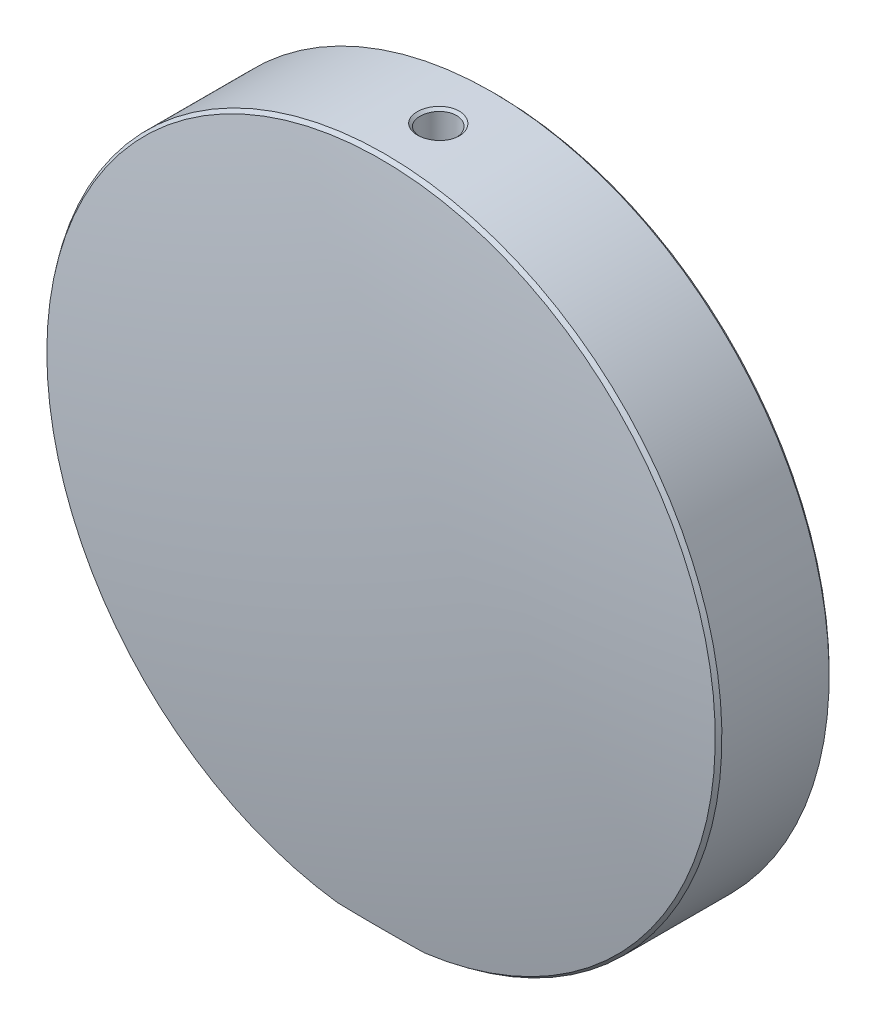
ISO-10303-21;
HEADER;
FILE_DESCRIPTION(('STEP AP214'),'2;1');
FILE_NAME('part.step','',(''),(''),'','','');
FILE_SCHEMA(('AUTOMOTIVE_DESIGN { 1 0 10303 214 1 1 1 1 }'));
ENDSEC;
DATA;
#1=APPLICATION_CONTEXT('core data for automotive mechanical design processes');
#2=APPLICATION_PROTOCOL_DEFINITION('international standard','automotive_design',2000,#1);
#3=PRODUCT_CONTEXT('',#1,'mechanical');
#4=PRODUCT('Part','Part','',(#3));
#5=PRODUCT_RELATED_PRODUCT_CATEGORY('part','',(#4));
#6=PRODUCT_DEFINITION_FORMATION('','',#4);
#7=PRODUCT_DEFINITION_CONTEXT('part definition',#1,'design');
#8=PRODUCT_DEFINITION('design','',#6,#7);
#9=PRODUCT_DEFINITION_SHAPE('','',#8);
#10=(LENGTH_UNIT() NAMED_UNIT(*) SI_UNIT(.MILLI.,.METRE.));
#11=(NAMED_UNIT(*) PLANE_ANGLE_UNIT() SI_UNIT($,.RADIAN.));
#12=(NAMED_UNIT(*) SI_UNIT($,.STERADIAN.) SOLID_ANGLE_UNIT());
#13=UNCERTAINTY_MEASURE_WITH_UNIT(LENGTH_MEASURE(1.E-05),#10,'distance_accuracy_value','');
#14=(GEOMETRIC_REPRESENTATION_CONTEXT(3) GLOBAL_UNCERTAINTY_ASSIGNED_CONTEXT((#13)) GLOBAL_UNIT_ASSIGNED_CONTEXT((#10,
#11,#12)) REPRESENTATION_CONTEXT('',''));
#15=CARTESIAN_POINT('',(0.,0.,0.));
#16=DIRECTION('',(0.,0.,1.));
#17=DIRECTION('',(1.,0.,0.));
#18=AXIS2_PLACEMENT_3D('',#15,#16,#17);
#19=CARTESIAN_POINT('',(0.,0.,355.));
#20=DIRECTION('',(0.,0.,-1.));
#21=DIRECTION('',(1.,0.,0.));
#22=AXIS2_PLACEMENT_3D('',#19,#20,#21);
#23=SPHERICAL_SURFACE('',#22,370.);
#24=CARTESIAN_POINT('',(0.,-59.,355.));
#25=DIRECTION('',(0.,1.,0.));
#26=DIRECTION('',(0.,0.,1.));
#27=AXIS2_PLACEMENT_3D('',#24,#25,#26);
#28=CIRCLE('',#27,365.265656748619);
#29=CARTESIAN_POINT('',(-6.90145713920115,-59.,-10.2004516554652));
#30=VERTEX_POINT('',#29);
#31=CARTESIAN_POINT('',(6.90145713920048,-59.,-10.2004516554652));
#32=VERTEX_POINT('',#31);
#33=EDGE_CURVE('E80',#30,#32,#28,.F.);
#34=ORIENTED_EDGE('',*,*,#33,.F.);
#35=CARTESIAN_POINT('',(0.,0.,-10.2004516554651));
#36=DIRECTION('',(0.,0.,1.));
#37=DIRECTION('',(1.,0.,0.));
#38=AXIS2_PLACEMENT_3D('',#35,#36,#37);
#39=CIRCLE('',#38,59.4022736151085);
#40=EDGE_CURVE('E43',#30,#32,#39,.F.);
#41=ORIENTED_EDGE('',*,*,#40,.T.);
#42=EDGE_LOOP('',(#34,#41));
#43=FACE_BOUND('',#42,.T.);
#44=ADVANCED_FACE('F31',(#43),#23,.T.);
#45=CARTESIAN_POINT('',(0.,0.,-355.));
#46=DIRECTION('',(0.,0.,-1.));
#47=DIRECTION('',(-1.,0.,0.));
#48=AXIS2_PLACEMENT_3D('',#45,#46,#47);
#49=SPHERICAL_SURFACE('',#48,370.);
#50=CARTESIAN_POINT('',(0.,-59.,-355.));
#51=DIRECTION('',(0.,1.,0.));
#52=DIRECTION('',(0.,0.,1.));
#53=AXIS2_PLACEMENT_3D('',#50,#51,#52);
#54=CIRCLE('',#53,365.265656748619);
#55=CARTESIAN_POINT('',(7.75052829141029,-59.,10.1834187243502));
#56=VERTEX_POINT('',#55);
#57=CARTESIAN_POINT('',(-7.75052829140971,-59.,10.1834187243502));
#58=VERTEX_POINT('',#57);
#59=EDGE_CURVE('E90',#56,#58,#54,.F.);
#60=ORIENTED_EDGE('',*,*,#59,.F.);
#61=CARTESIAN_POINT('',(0.,0.,10.1834187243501));
#62=DIRECTION('',(0.,0.,-1.));
#63=DIRECTION('',(-1.,0.,0.));
#64=AXIS2_PLACEMENT_3D('',#61,#62,#63);
#65=CIRCLE('',#64,59.5068961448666);
#66=EDGE_CURVE('E11',#56,#58,#65,.F.);
#67=ORIENTED_EDGE('',*,*,#66,.T.);
#68=EDGE_LOOP('',(#60,#67));
#69=FACE_BOUND('',#68,.T.);
#70=ADVANCED_FACE('F183',(#69),#49,.T.);
#71=CARTESIAN_POINT('',(0.,0.,-15.));
#72=DIRECTION('',(0.,0.,-1.));
#73=DIRECTION('',(-1.,0.,0.));
#74=AXIS2_PLACEMENT_3D('',#71,#72,#73);
#75=CYLINDRICAL_SURFACE('',#74,60.0000000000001);
#76=CARTESIAN_POINT('',(0.,60.0000000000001,3.71918708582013));
#77=CARTESIAN_POINT('',(0.98309913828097,59.99999827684,3.71915412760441));
#78=CARTESIAN_POINT('',(1.95547267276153,59.9727258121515,3.31800584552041));
#79=CARTESIAN_POINT('',(3.34418440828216,59.9101905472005,1.94125209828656));
#80=CARTESIAN_POINT('',(3.7471732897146,59.8828813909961,0.976504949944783));
#81=CARTESIAN_POINT('',(3.74700745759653,59.8828785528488,-0.972626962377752));
#82=CARTESIAN_POINT('',(3.34579960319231,59.9101294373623,-1.93867792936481));
#83=CARTESIAN_POINT('',(1.95610115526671,59.9726877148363,-3.31835170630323));
#84=CARTESIAN_POINT('',(0.98805830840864,59.9999988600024,-3.71916027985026));
#85=CARTESIAN_POINT('',(-0.988039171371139,60.0000011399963,-3.71921389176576));
#86=CARTESIAN_POINT('',(-1.9559865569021,59.9726924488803,-3.31845552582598));
#87=CARTESIAN_POINT('',(-3.34570013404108,59.9101341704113,-1.93878679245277));
#88=CARTESIAN_POINT('',(-3.74700972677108,59.8828779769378,-0.972599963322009));
#89=CARTESIAN_POINT('',(-3.74717094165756,59.882881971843,0.976625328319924));
#90=CARTESIAN_POINT('',(-3.34413653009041,59.9101910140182,1.94125290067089));
#91=CARTESIAN_POINT('',(-1.95552604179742,59.9727251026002,3.3179995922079));
#92=CARTESIAN_POINT('',(-0.983099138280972,60.0000017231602,3.71922004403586));
#93=CARTESIAN_POINT('',(0.,60.0000000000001,3.71918708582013));
#94=B_SPLINE_CURVE_WITH_KNOTS('',3,(#76,#77,#78,#79,#80,#81,#82,#83,#84,#85,#86,#87,#88,#89,#90,
#91,#92,#93),.UNSPECIFIED.,.T.,.F.,(4,2,2,2,2,2,2,2,4),(-0.023256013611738,-0.0203486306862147,
-0.0174412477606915,-0.0145338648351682,-0.0116264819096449,-0.00871909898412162,
-0.00581171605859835,-0.00290433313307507,3.04979244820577E-06),.UNSPECIFIED.);
#95=CARTESIAN_POINT('',(0.,60.0000000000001,3.71918708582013));
#96=VERTEX_POINT('',#95);
#97=EDGE_CURVE('E93',#96,#96,#94,.F.);
#98=ORIENTED_EDGE('',*,*,#97,.T.);
#99=EDGE_LOOP('',(#98));
#100=FACE_BOUND('',#99,.T.);
#101=DIRECTION('',(0.,0.,-1.));
#102=VECTOR('',#101,1.);
#103=CARTESIAN_POINT('',(10.9087121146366,-58.9999999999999,-15.));
#104=LINE('',#103,#102);
#105=CARTESIAN_POINT('',(10.9087121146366,-58.9999999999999,-9.6027252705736));
#106=VERTEX_POINT('',#105);
#107=CARTESIAN_POINT('',(10.9087121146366,-58.9999999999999,9.49637211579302));
#108=VERTEX_POINT('',#107);
#109=EDGE_CURVE('E89',#106,#108,#104,.F.);
#110=ORIENTED_EDGE('',*,*,#109,.F.);
#111=CARTESIAN_POINT('',(0.,0.,-9.6027252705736));
#112=DIRECTION('',(0.,0.,-1.));
#113=DIRECTION('',(-1.,0.,0.));
#114=AXIS2_PLACEMENT_3D('',#111,#112,#113);
#115=CIRCLE('',#114,60.0000000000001);
#116=CARTESIAN_POINT('',(-10.9087121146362,-59.,-9.6027252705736));
#117=VERTEX_POINT('',#116);
#118=EDGE_CURVE('E51',#106,#117,#115,.F.);
#119=ORIENTED_EDGE('',*,*,#118,.T.);
#120=DIRECTION('',(0.,0.,-1.));
#121=VECTOR('',#120,1.);
#122=CARTESIAN_POINT('',(-10.9087121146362,-59.,-15.));
#123=LINE('',#122,#121);
#124=CARTESIAN_POINT('',(-10.9087121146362,-59.,9.49637211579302));
#125=VERTEX_POINT('',#124);
#126=EDGE_CURVE('E81',#125,#117,#123,.T.);
#127=ORIENTED_EDGE('',*,*,#126,.F.);
#128=CARTESIAN_POINT('',(0.,0.,9.49637211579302));
#129=DIRECTION('',(0.,0.,1.));
#130=DIRECTION('',(1.,0.,0.));
#131=AXIS2_PLACEMENT_3D('',#128,#129,#130);
#132=CIRCLE('',#131,60.0000000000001);
#133=EDGE_CURVE('E174',#125,#108,#132,.F.);
#134=ORIENTED_EDGE('',*,*,#133,.T.);
#135=EDGE_LOOP('',(#110,#119,#127,#134));
#136=FACE_BOUND('',#135,.T.);
#137=ADVANCED_FACE('F149',(#100,#136),#75,.T.);
#138=CARTESIAN_POINT('',(-10.9087121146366,-59.,-15.));
#139=DIRECTION('',(0.,1.,0.));
#140=DIRECTION('',(0.,0.,1.));
#141=AXIS2_PLACEMENT_3D('',#138,#139,#140);
#142=PLANE('',#141);
#143=CARTESIAN_POINT('',(0.,-59.,0.));
#144=DIRECTION('',(0.,1.,0.));
#145=DIRECTION('',(0.,0.,1.));
#146=AXIS2_PLACEMENT_3D('',#143,#144,#145);
#147=CIRCLE('',#146,3.74999999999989);
#148=CARTESIAN_POINT('',(0.,-59.,3.74999999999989));
#149=VERTEX_POINT('',#148);
#150=EDGE_CURVE('E143',#149,#149,#147,.T.);
#151=ORIENTED_EDGE('',*,*,#150,.T.);
#152=EDGE_LOOP('',(#151));
#153=FACE_BOUND('',#152,.T.);
#154=ORIENTED_EDGE('',*,*,#33,.T.);
#155=CARTESIAN_POINT('',(6.90145713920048,-59.,-10.2004516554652));
#156=CARTESIAN_POINT('',(7.23693616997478,-59.,-10.1614766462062));
#157=CARTESIAN_POINT('',(7.57209222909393,-59.,-10.1197325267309));
#158=CARTESIAN_POINT('',(8.24159408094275,-59.,-10.0308034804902));
#159=CARTESIAN_POINT('',(8.57594006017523,-59.,-9.98361995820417));
#160=CARTESIAN_POINT('',(9.24382887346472,-59.,-9.88388957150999));
#161=CARTESIAN_POINT('',(9.57737171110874,-59.,-9.83134273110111));
#162=CARTESIAN_POINT('',(10.2436710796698,-59.,-9.72096853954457));
#163=CARTESIAN_POINT('',(10.5764273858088,-59.,-9.66313983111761));
#164=CARTESIAN_POINT('',(10.9087121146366,-59.,-9.60272527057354));
#165=B_SPLINE_CURVE_WITH_KNOTS('',3,(#155,#156,#157,#158,#159,#160,#161,#162,#163,#164),
.UNSPECIFIED.,.F.,.F.,(4,2,2,2,4),(0.,1.01319304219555,2.02612505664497,3.03905253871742,
4.05224104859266),.UNSPECIFIED.);
#166=EDGE_CURVE('E84',#32,#106,#165,.T.);
#167=ORIENTED_EDGE('',*,*,#166,.T.);
#168=ORIENTED_EDGE('',*,*,#109,.T.);
#169=CARTESIAN_POINT('',(10.9087121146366,-58.9999999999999,9.49637211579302));
#170=CARTESIAN_POINT('',(10.6475336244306,-59.,9.56253476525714));
#171=CARTESIAN_POINT('',(10.3858063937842,-59.,9.62653721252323));
#172=CARTESIAN_POINT('',(9.86138802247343,-59.,9.75010480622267));
#173=CARTESIAN_POINT('',(9.59869718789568,-59.,9.80967125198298));
#174=CARTESIAN_POINT('',(9.07233019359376,-59.,9.92428926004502));
#175=CARTESIAN_POINT('',(8.80865402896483,-59.,9.97934079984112));
#176=CARTESIAN_POINT('',(8.28030419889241,-59.,10.0848523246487));
#177=CARTESIAN_POINT('',(8.01563026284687,-59.,10.1353109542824));
#178=CARTESIAN_POINT('',(7.75052829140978,-59.,10.1834187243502));
#179=B_SPLINE_CURVE_WITH_KNOTS('',3,(#169,#170,#171,#172,#173,#174,#175,#176,#177,#178),
.UNSPECIFIED.,.F.,.F.,(4,2,2,2,4),(0.,0.808278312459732,1.61631893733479,2.4243635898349,
3.23264593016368),.UNSPECIFIED.);
#180=EDGE_CURVE('E85',#108,#56,#179,.T.);
#181=ORIENTED_EDGE('',*,*,#180,.T.);
#182=ORIENTED_EDGE('',*,*,#59,.T.);
#183=CARTESIAN_POINT('',(-7.75052829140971,-59.,10.1834187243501));
#184=CARTESIAN_POINT('',(-8.01563026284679,-59.,10.1353109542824));
#185=CARTESIAN_POINT('',(-8.2803041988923,-59.,10.0848523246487));
#186=CARTESIAN_POINT('',(-8.80865402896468,-59.,9.97934079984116));
#187=CARTESIAN_POINT('',(-9.07233019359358,-59.,9.92428926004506));
#188=CARTESIAN_POINT('',(-9.59869718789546,-59.,9.80967125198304));
#189=CARTESIAN_POINT('',(-9.86138802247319,-59.,9.75010480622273));
#190=CARTESIAN_POINT('',(-10.3858063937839,-59.,9.62653721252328));
#191=CARTESIAN_POINT('',(-10.6475336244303,-59.,9.56253476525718));
#192=CARTESIAN_POINT('',(-10.9087121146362,-59.,9.49637211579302));
#193=B_SPLINE_CURVE_WITH_KNOTS('',3,(#183,#184,#185,#186,#187,#188,#189,#190,#191,#192),
.UNSPECIFIED.,.F.,.F.,(4,2,2,2,4),(0.,0.808282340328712,1.61632699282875,2.42436761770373,
3.23264593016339),.UNSPECIFIED.);
#194=EDGE_CURVE('E58',#58,#125,#193,.T.);
#195=ORIENTED_EDGE('',*,*,#194,.T.);
#196=ORIENTED_EDGE('',*,*,#126,.T.);
#197=CARTESIAN_POINT('',(-10.9087121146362,-59.,-9.6027252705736));
#198=CARTESIAN_POINT('',(-10.5764273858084,-59.,-9.66313983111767));
#199=CARTESIAN_POINT('',(-10.2436710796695,-59.,-9.72096853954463));
#200=CARTESIAN_POINT('',(-9.5773717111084,-59.,-9.83134273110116));
#201=CARTESIAN_POINT('',(-9.24382887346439,-59.,-9.88388957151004));
#202=CARTESIAN_POINT('',(-8.57594006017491,-59.,-9.98361995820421));
#203=CARTESIAN_POINT('',(-8.24159408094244,-59.,-10.0308034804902));
#204=CARTESIAN_POINT('',(-7.57209222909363,-59.,-10.119732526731));
#205=CARTESIAN_POINT('',(-7.23693616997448,-59.,-10.1614766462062));
#206=CARTESIAN_POINT('',(-6.90145713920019,-59.,-10.2004516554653));
#207=B_SPLINE_CURVE_WITH_KNOTS('',3,(#197,#198,#199,#200,#201,#202,#203,#204,#205,#206),
.UNSPECIFIED.,.F.,.F.,(4,2,2,2,4),(0.,1.01318850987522,2.02611599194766,3.03904800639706,
4.0522410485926),.UNSPECIFIED.);
#208=EDGE_CURVE('E77',#117,#30,#207,.T.);
#209=ORIENTED_EDGE('',*,*,#208,.T.);
#210=EDGE_LOOP('',(#154,#167,#168,#181,#182,#195,#196,#209));
#211=FACE_BOUND('',#210,.T.);
#212=ADVANCED_FACE('F79',(#153,#211),#142,.F.);
#213=CARTESIAN_POINT('',(0.,-60.,0.));
#214=DIRECTION('',(0.,1.,0.));
#215=DIRECTION('',(0.,0.,1.));
#216=AXIS2_PLACEMENT_3D('',#213,#214,#215);
#217=CYLINDRICAL_SURFACE('',#216,3.25);
#218=CARTESIAN_POINT('',(0.,-58.5000000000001,0.));
#219=DIRECTION('',(0.,1.,0.));
#220=DIRECTION('',(0.,0.,1.));
#221=AXIS2_PLACEMENT_3D('',#218,#219,#220);
#222=CIRCLE('',#221,3.25);
#223=CARTESIAN_POINT('',(0.,-58.5000000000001,3.25));
#224=VERTEX_POINT('',#223);
#225=EDGE_CURVE('E175',#224,#224,#222,.F.);
#226=ORIENTED_EDGE('',*,*,#225,.T.);
#227=EDGE_LOOP('',(#226));
#228=FACE_BOUND('',#227,.T.);
#229=CARTESIAN_POINT('',(0.,59.5531926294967,3.24999999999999));
#230=CARTESIAN_POINT('',(-0.0532619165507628,59.5531928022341,3.25000258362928));
#231=CARTESIAN_POINT('',(-0.106521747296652,59.5530872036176,3.24863553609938));
#232=CARTESIAN_POINT('',(-0.212855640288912,59.552675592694,3.24320839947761));
#233=CARTESIAN_POINT('',(-0.265929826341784,59.5523697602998,3.23915072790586));
#234=CARTESIAN_POINT('',(-0.371778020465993,59.5515689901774,3.22839134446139));
#235=CARTESIAN_POINT('',(-0.424552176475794,59.5510741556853,3.22169107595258));
#236=CARTESIAN_POINT('',(-0.529687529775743,59.5499067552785,3.20569630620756));
#237=CARTESIAN_POINT('',(-0.582048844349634,59.5492342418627,3.1964025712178));
#238=CARTESIAN_POINT('',(-0.686245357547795,59.5477228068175,3.17527007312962));
#239=CARTESIAN_POINT('',(-0.738080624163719,59.546883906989,3.16343164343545));
#240=CARTESIAN_POINT('',(-0.841112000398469,59.5450510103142,3.13725880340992));
#241=CARTESIAN_POINT('',(-0.892308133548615,59.5440570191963,3.1229244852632));
#242=CARTESIAN_POINT('',(-0.99394815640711,59.5419252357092,3.0918087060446));
#243=CARTESIAN_POINT('',(-1.0443920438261,59.5407874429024,3.07502723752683));
#244=CARTESIAN_POINT('',(-1.14441446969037,59.5383793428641,3.03906586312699));
#245=CARTESIAN_POINT('',(-1.1939930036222,59.5371090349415,3.0198859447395));
#246=CARTESIAN_POINT('',(-1.2921715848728,59.5344471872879,2.97917628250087));
#247=CARTESIAN_POINT('',(-1.34077164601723,59.5330556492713,2.95764657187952));
#248=CARTESIAN_POINT('',(-1.43688012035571,59.5301626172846,2.91228588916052));
#249=CARTESIAN_POINT('',(-1.48438857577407,59.528661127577,2.88845500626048));
#250=CARTESIAN_POINT('',(-1.5782006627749,59.5255594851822,2.83854053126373));
#251=CARTESIAN_POINT('',(-1.62450435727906,59.5239593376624,2.81245705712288));
#252=CARTESIAN_POINT('',(-1.71579376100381,59.5206716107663,2.75808598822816));
#253=CARTESIAN_POINT('',(-1.76077952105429,59.5189840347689,2.72979847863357));
#254=CARTESIAN_POINT('',(-1.84931990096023,59.5155329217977,2.67106795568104));
#255=CARTESIAN_POINT('',(-1.89287449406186,59.5137693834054,2.6406249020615));
#256=CARTESIAN_POINT('',(-1.97843955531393,59.5101769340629,2.57763212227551));
#257=CARTESIAN_POINT('',(-2.02044981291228,59.5083480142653,2.54508211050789));
#258=CARTESIAN_POINT('',(-2.10281294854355,59.5046386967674,2.4779239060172));
#259=CARTESIAN_POINT('',(-2.14316527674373,59.5027582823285,2.4433150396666));
#260=CARTESIAN_POINT('',(-2.22210088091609,59.4989475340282,2.37208946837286));
#261=CARTESIAN_POINT('',(-2.26068305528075,59.4970171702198,2.33547154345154));
#262=CARTESIAN_POINT('',(-2.33591986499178,59.4931563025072,2.26031365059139));
#263=CARTESIAN_POINT('',(-2.37257469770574,59.4912257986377,2.22177388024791));
#264=CARTESIAN_POINT('',(-2.44385968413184,59.4874145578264,2.14291973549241));
#265=CARTESIAN_POINT('',(-2.47849142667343,59.4855337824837,2.10260679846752));
#266=CARTESIAN_POINT('',(-2.54568487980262,59.4818235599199,2.02032198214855));
#267=CARTESIAN_POINT('',(-2.57824757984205,59.4799940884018,1.97835091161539));
#268=CARTESIAN_POINT('',(-2.64125592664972,59.4764003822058,1.89286352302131));
#269=CARTESIAN_POINT('',(-2.67170212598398,59.4746361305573,1.84934761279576));
#270=CARTESIAN_POINT('',(-2.73043067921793,59.471183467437,1.76088447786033));
#271=CARTESIAN_POINT('',(-2.75871329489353,59.4694950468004,1.71593742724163));
#272=CARTESIAN_POINT('',(-2.81306762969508,59.466205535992,1.6247256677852));
#273=CARTESIAN_POINT('',(-2.83913944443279,59.4646044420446,1.57846101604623));
#274=CARTESIAN_POINT('',(-2.88902502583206,59.461500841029,1.48472763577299));
#275=CARTESIAN_POINT('',(-2.91283881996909,59.4599983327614,1.43725892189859));
#276=CARTESIAN_POINT('',(-2.95816109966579,59.4571032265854,1.3412309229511));
#277=CARTESIAN_POINT('',(-2.9796696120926,59.4557106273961,1.29267165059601));
#278=CARTESIAN_POINT('',(-3.0203340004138,59.4530466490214,1.19457600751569));
#279=CARTESIAN_POINT('',(-3.03948993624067,59.4517752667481,1.14503966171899));
#280=CARTESIAN_POINT('',(-3.07540180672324,59.4493650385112,1.04510333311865));
#281=CARTESIAN_POINT('',(-3.09215783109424,59.4482261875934,0.994703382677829));
#282=CARTESIAN_POINT('',(-3.12322252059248,59.4460923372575,0.893153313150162));
#283=CARTESIAN_POINT('',(-3.13753126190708,59.4450973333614,0.842003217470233));
#284=CARTESIAN_POINT('',(-3.16365405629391,59.4432624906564,0.73906634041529));
#285=CARTESIAN_POINT('',(-3.17546808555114,59.4424226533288,0.687279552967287));
#286=CARTESIAN_POINT('',(-3.19655426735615,59.4409094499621,0.583182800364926));
#287=CARTESIAN_POINT('',(-3.20582616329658,59.4402361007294,0.530872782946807));
#288=CARTESIAN_POINT('',(-3.22178082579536,59.4390671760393,0.425843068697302));
#289=CARTESIAN_POINT('',(-3.22846292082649,59.4385716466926,0.373123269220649));
#290=CARTESIAN_POINT('',(-3.23919165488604,59.4377696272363,0.267387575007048));
#291=CARTESIAN_POINT('',(-3.24323697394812,59.4374632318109,0.214371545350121));
#292=CARTESIAN_POINT('',(-3.24864329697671,59.4370508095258,0.108156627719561));
#293=CARTESIAN_POINT('',(-3.25000204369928,59.4369449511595,0.0549576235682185));
#294=CARTESIAN_POINT('',(-3.24999700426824,59.4369445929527,-0.0514453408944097));
#295=CARTESIAN_POINT('',(-3.24863294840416,59.4370501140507,-0.104649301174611));
#296=CARTESIAN_POINT('',(-3.24323099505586,59.4374613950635,-0.210884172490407));
#297=CARTESIAN_POINT('',(-3.23919487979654,59.4377670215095,-0.263915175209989));
#298=CARTESIAN_POINT('',(-3.22849331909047,59.4385672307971,-0.369690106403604));
#299=CARTESIAN_POINT('',(-3.22182881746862,59.4390617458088,-0.422434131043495));
#300=CARTESIAN_POINT('',(-3.20591741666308,59.4402283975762,-0.52752090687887));
#301=CARTESIAN_POINT('',(-3.19667089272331,59.4409005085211,-0.579863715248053));
#302=CARTESIAN_POINT('',(-3.17564137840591,59.4424110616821,-0.684033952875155));
#303=CARTESIAN_POINT('',(-3.16385841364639,59.4432495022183,-0.73586138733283));
#304=CARTESIAN_POINT('',(-3.13780193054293,59.4450814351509,-0.838886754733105));
#305=CARTESIAN_POINT('',(-3.12352825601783,59.4460749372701,-0.890084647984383));
#306=CARTESIAN_POINT('',(-3.09253604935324,59.44820572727,-0.991736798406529));
#307=CARTESIAN_POINT('',(-3.07581729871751,59.4493430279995,-1.0421909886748));
#308=CARTESIAN_POINT('',(-3.03998053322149,59.4517501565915,-1.14224157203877));
#309=CARTESIAN_POINT('',(-3.02086231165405,59.4530199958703,-1.1918378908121));
#310=CARTESIAN_POINT('',(-2.98027212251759,59.4556809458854,-1.29005854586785));
#311=CARTESIAN_POINT('',(-2.9587999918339,59.4570720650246,-1.33868281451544));
#312=CARTESIAN_POINT('',(-2.91354747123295,59.459964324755,-1.43484516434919));
#313=CARTESIAN_POINT('',(-2.88976695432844,59.4614654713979,-1.4823831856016));
#314=CARTESIAN_POINT('',(-2.8399431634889,59.4645665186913,-1.57625884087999));
#315=CARTESIAN_POINT('',(-2.81389975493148,59.4661664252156,-1.62259640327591));
#316=CARTESIAN_POINT('',(-2.75959569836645,59.469453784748,-1.71395693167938));
#317=CARTESIAN_POINT('',(-2.73133483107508,59.4711412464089,-1.75897976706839));
#318=CARTESIAN_POINT('',(-2.6726415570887,59.474592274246,-1.84759678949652));
#319=CARTESIAN_POINT('',(-2.6422087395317,59.4763558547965,-1.89119070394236));
#320=CARTESIAN_POINT('',(-2.57921697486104,59.4799485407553,-1.97683551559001));
#321=CARTESIAN_POINT('',(-2.54665729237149,59.4817776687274,-2.01888587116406));
#322=CARTESIAN_POINT('',(-2.47945881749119,59.4854876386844,-2.10133083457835));
#323=CARTESIAN_POINT('',(-2.44481881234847,59.4873685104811,-2.14172445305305));
#324=CARTESIAN_POINT('',(-2.37350134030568,59.4911802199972,-2.22073777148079));
#325=CARTESIAN_POINT('',(-2.33682201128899,59.4931111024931,-2.2593557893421));
#326=CARTESIAN_POINT('',(-2.2615455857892,59.4969730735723,-2.33466374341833));
#327=CARTESIAN_POINT('',(-2.22294875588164,59.4989041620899,-2.37135394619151));
#328=CARTESIAN_POINT('',(-2.14401298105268,59.5027166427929,-2.4427133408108));
#329=CARTESIAN_POINT('',(-2.1036761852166,59.5045980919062,-2.47738490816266));
#330=CARTESIAN_POINT('',(-2.02136424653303,59.5083095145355,-2.54465568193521));
#331=CARTESIAN_POINT('',(-1.97939049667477,59.5101395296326,-2.57725659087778));
#332=CARTESIAN_POINT('',(-1.89391350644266,59.5137342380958,-2.64034034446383));
#333=CARTESIAN_POINT('',(-1.85041110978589,59.5154989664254,-2.67082433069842));
#334=CARTESIAN_POINT('',(-1.76198405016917,59.5189524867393,-2.72962686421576));
#335=CARTESIAN_POINT('',(-1.71705984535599,59.5206413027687,-2.75794609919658));
#336=CARTESIAN_POINT('',(-1.62589662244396,59.5239315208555,-2.81237205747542));
#337=CARTESIAN_POINT('',(-1.57965779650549,59.5255329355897,-2.83847910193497));
#338=CARTESIAN_POINT('',(-1.48597256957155,59.5286371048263,-2.88843340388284));
#339=CARTESIAN_POINT('',(-1.43852617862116,59.530139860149,-2.91228068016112));
#340=CARTESIAN_POINT('',(-1.34253300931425,59.5330354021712,-2.95766813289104));
#341=CARTESIAN_POINT('',(-1.29398611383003,59.5344281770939,-2.97920806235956));
#342=CARTESIAN_POINT('',(-1.19589906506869,59.5370924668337,-3.01993346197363));
#343=CARTESIAN_POINT('',(-1.14635870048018,59.5383639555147,-3.03911842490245));
#344=CARTESIAN_POINT('',(-1.04639181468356,59.5407743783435,-3.07508652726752));
#345=CARTESIAN_POINT('',(-0.995965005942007,59.5419132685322,-3.09186887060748));
#346=CARTESIAN_POINT('',(-0.894332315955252,59.544047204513,-3.12298439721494));
#347=CARTESIAN_POINT('',(-0.843126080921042,59.5450421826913,-3.13731642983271));
#348=CARTESIAN_POINT('',(-0.740041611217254,59.546877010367,-3.16348406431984));
#349=CARTESIAN_POINT('',(-0.688162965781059,59.5477167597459,-3.17531805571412));
#350=CARTESIAN_POINT('',(-0.583840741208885,59.5492298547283,-3.19644244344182));
#351=CARTESIAN_POINT('',(-0.531396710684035,59.5499030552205,-3.20573062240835));
#352=CARTESIAN_POINT('',(-0.426050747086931,59.5510717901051,-3.22171636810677));
#353=CARTESIAN_POINT('',(-0.373148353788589,59.5515671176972,-3.22841092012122));
#354=CARTESIAN_POINT('',(-0.266992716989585,59.5523688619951,-3.23916259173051));
#355=CARTESIAN_POINT('',(-0.213739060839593,59.5526749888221,-3.24321566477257));
#356=CARTESIAN_POINT('',(-0.106987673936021,59.5530871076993,-3.24863777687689));
#357=CARTESIAN_POINT('',(-0.0534896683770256,59.5531927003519,-3.25000145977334));
#358=CARTESIAN_POINT('',(0.0535066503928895,59.5531925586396,-3.24999854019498));
#359=CARTESIAN_POINT('',(0.107004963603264,59.5530868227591,-3.24863191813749));
#360=CARTESIAN_POINT('',(0.213757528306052,59.5526744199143,-3.24320401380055));
#361=CARTESIAN_POINT('',(0.267012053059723,59.5523681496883,-3.23914805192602));
#362=CARTESIAN_POINT('',(0.373169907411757,59.5515661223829,-3.22839069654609));
#363=CARTESIAN_POINT('',(0.426073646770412,59.5510706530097,-3.22169331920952));
#364=CARTESIAN_POINT('',(0.531422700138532,59.5499016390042,-3.20570203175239));
#365=CARTESIAN_POINT('',(0.583868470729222,59.5492282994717,-3.19641111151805));
#366=CARTESIAN_POINT('',(0.688194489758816,59.5477149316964,-3.17528136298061));
#367=CARTESIAN_POINT('',(0.740075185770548,59.5468750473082,-3.16344473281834));
#368=CARTESIAN_POINT('',(0.843163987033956,59.5450399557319,-3.13727195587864));
#369=CARTESIAN_POINT('',(0.894372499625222,59.5440448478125,-3.12293740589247));
#370=CARTESIAN_POINT('',(0.996009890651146,59.5419106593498,-3.09181699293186));
#371=CARTESIAN_POINT('',(1.04643912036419,59.5407716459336,-3.07503227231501));
#372=CARTESIAN_POINT('',(1.14641090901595,59.538360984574,-3.03905957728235));
#373=CARTESIAN_POINT('',(1.19595375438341,59.5370893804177,-3.01987239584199));
#374=CARTESIAN_POINT('',(1.29404574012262,59.534424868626,-2.97914273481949));
#375=CARTESIAN_POINT('',(1.34259509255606,59.5330319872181,-2.95760076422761));
#376=CARTESIAN_POINT('',(1.43859306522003,59.5301362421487,-2.91220941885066));
#377=CARTESIAN_POINT('',(1.48604180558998,59.5286333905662,-2.88836029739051));
#378=CARTESIAN_POINT('',(1.57973153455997,59.5255290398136,-2.83840250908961));
#379=CARTESIAN_POINT('',(1.62597251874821,59.5239275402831,-2.81229383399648));
#380=CARTESIAN_POINT('',(1.7171397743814,59.5206371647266,-2.75786483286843));
#381=CARTESIAN_POINT('',(1.76206586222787,59.5189482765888,-2.72954419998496));
#382=CARTESIAN_POINT('',(1.85049631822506,59.5154946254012,-2.670739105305));
#383=CARTESIAN_POINT('',(1.89400023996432,59.5137298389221,-2.64025397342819));
#384=CARTESIAN_POINT('',(1.97947981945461,59.5101350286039,-2.57716817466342));
#385=CARTESIAN_POINT('',(2.02145464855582,59.5083049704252,-2.54456638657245));
#386=CARTESIAN_POINT('',(2.1037682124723,59.504593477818,-2.47729413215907));
#387=CARTESIAN_POINT('',(2.1441055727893,59.5027120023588,-2.4426219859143));
#388=CARTESIAN_POINT('',(2.22304179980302,59.4988994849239,-2.37126167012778));
#389=CARTESIAN_POINT('',(2.26163853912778,59.4969683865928,-2.33457114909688));
#390=CARTESIAN_POINT('',(2.33691410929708,59.493106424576,-2.25926314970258));
#391=CARTESIAN_POINT('',(2.37359270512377,59.4911755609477,-2.22064543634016));
#392=CARTESIAN_POINT('',(2.44490816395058,59.4873639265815,-2.14163358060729));
#393=CARTESIAN_POINT('',(2.47954692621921,59.4854831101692,-2.1012411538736));
#394=CARTESIAN_POINT('',(2.54674239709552,59.4817732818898,-2.01879928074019));
#395=CARTESIAN_POINT('',(2.57930035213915,59.4799442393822,-1.97675085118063));
#396=CARTESIAN_POINT('',(2.64228824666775,59.4763517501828,-1.89111052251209));
#397=CARTESIAN_POINT('',(2.67271895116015,59.4745882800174,-1.84751918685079));
#398=CARTESIAN_POINT('',(2.73140766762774,59.4711374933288,-1.7589078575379));
#399=CARTESIAN_POINT('',(2.75966611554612,59.4694501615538,-1.71388815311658));
#400=CARTESIAN_POINT('',(2.81396509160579,59.4661630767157,-1.6225343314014));
#401=CARTESIAN_POINT('',(2.84000585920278,59.464563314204,-1.57620035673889));
#402=CARTESIAN_POINT('',(2.88982421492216,59.4614625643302,-1.4823322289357));
#403=CARTESIAN_POINT('',(2.91360195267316,59.4599615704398,-1.4347981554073));
#404=CARTESIAN_POINT('',(2.95884885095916,59.4570696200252,-1.33864396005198));
#405=CARTESIAN_POINT('',(2.9803181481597,59.4556786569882,-1.2900239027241));
#406=CARTESIAN_POINT('',(3.0209026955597,59.453018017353,-1.19181183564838));
#407=CARTESIAN_POINT('',(3.04001811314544,59.4517483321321,-1.14221989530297));
#408=CARTESIAN_POINT('',(3.07584938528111,59.4493415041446,-1.04217813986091));
#409=CARTESIAN_POINT('',(3.09256544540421,59.4482043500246,-0.991728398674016));
#410=CARTESIAN_POINT('',(3.12355247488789,59.4460738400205,-0.890085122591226));
#411=CARTESIAN_POINT('',(3.13782365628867,59.4450804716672,-0.838891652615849));
#412=CARTESIAN_POINT('',(3.16387544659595,59.4432487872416,-0.735875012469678));
#413=CARTESIAN_POINT('',(3.1756562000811,59.4424104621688,-0.68405187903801));
#414=CARTESIAN_POINT('',(3.19668167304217,59.4409001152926,-0.579890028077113));
#415=CARTESIAN_POINT('',(3.20592635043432,59.4402280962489,-0.527551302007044));
#416=CARTESIAN_POINT('',(3.2218345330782,59.4390615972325,-0.42247237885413));
#417=CARTESIAN_POINT('',(3.2284976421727,59.4385671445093,-0.369732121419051));
#418=CARTESIAN_POINT('',(3.23919696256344,59.4377670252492,-0.263964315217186));
#419=CARTESIAN_POINT('',(3.24323220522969,59.4374614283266,-0.210936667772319));
#420=CARTESIAN_POINT('',(3.24863311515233,59.437050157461,-0.104708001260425));
#421=CARTESIAN_POINT('',(3.24999697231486,59.4369446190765,-0.0515068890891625));
#422=CARTESIAN_POINT('',(3.25000214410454,59.4369449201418,0.0548912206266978));
#423=CARTESIAN_POINT('',(3.24864368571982,59.4370507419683,0.108088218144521));
#424=CARTESIAN_POINT('',(3.24323817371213,59.437463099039,0.214300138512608));
#425=CARTESIAN_POINT('',(3.23919332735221,59.4377694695,0.267315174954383));
#426=CARTESIAN_POINT('',(3.22846577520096,59.4385714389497,0.373049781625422));
#427=CARTESIAN_POINT('',(3.22178434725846,59.4390669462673,0.425769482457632));
#428=CARTESIAN_POINT('',(3.20583117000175,59.4402358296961,0.530799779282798));
#429=CARTESIAN_POINT('',(3.19656005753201,59.4409091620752,0.583110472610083));
#430=CARTESIAN_POINT('',(3.1754755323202,59.4424223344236,0.68720923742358));
#431=CARTESIAN_POINT('',(3.16366234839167,59.4432621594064,0.73899735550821));
#432=CARTESIAN_POINT('',(3.13754126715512,59.4450969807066,0.841937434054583));
#433=CARTESIAN_POINT('',(3.12323337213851,59.4460919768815,0.893089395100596));
#434=CARTESIAN_POINT('',(3.09217033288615,59.4482258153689,0.994643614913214));
#435=CARTESIAN_POINT('',(3.07541509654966,59.4493646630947,1.04504584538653));
#436=CARTESIAN_POINT('',(3.03950469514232,59.4517748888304,1.1449870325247));
#437=CARTESIAN_POINT('',(3.02034942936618,59.4530462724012,1.19452595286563));
#438=CARTESIAN_POINT('',(2.97968621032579,59.4557102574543,1.29262692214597));
#439=CARTESIAN_POINT('',(2.95817819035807,59.4571028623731,1.34118894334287));
#440=CARTESIAN_POINT('',(2.91285666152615,59.459997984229,1.43722249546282));
#441=CARTESIAN_POINT('',(2.8890431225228,59.4615005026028,1.4846940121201));
#442=CARTESIAN_POINT('',(2.83915775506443,59.4646041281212,1.57843293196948));
#443=CARTESIAN_POINT('',(2.81308589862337,59.4662052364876,1.62470032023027));
#444=CARTESIAN_POINT('',(2.75873112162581,59.4694947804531,1.71591736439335));
#445=CARTESIAN_POINT('',(2.73044810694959,59.4711832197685,1.76086696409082));
#446=CARTESIAN_POINT('',(2.67171833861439,59.4746359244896,1.84933488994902));
#447=CARTESIAN_POINT('',(2.64127132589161,59.4764001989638,1.8928530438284));
#448=CARTESIAN_POINT('',(2.57826086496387,59.4799939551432,1.97834448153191));
#449=CARTESIAN_POINT('',(2.5456968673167,59.4818234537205,2.02031735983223));
#450=CARTESIAN_POINT('',(2.47850030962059,59.4855337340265,2.10260526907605));
#451=CARTESIAN_POINT('',(2.44386676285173,59.4874145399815,2.14291949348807));
#452=CARTESIAN_POINT('',(2.37257746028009,59.4912258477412,2.22177543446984));
#453=CARTESIAN_POINT('',(2.33592011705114,59.4931563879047,2.26031571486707));
#454=CARTESIAN_POINT('',(2.2606783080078,59.4970173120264,2.33547397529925));
#455=CARTESIAN_POINT('',(2.22209365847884,59.498947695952,2.3720917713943));
#456=CARTESIAN_POINT('',(2.14315382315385,59.5027584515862,2.44331674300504));
#457=CARTESIAN_POINT('',(2.10279976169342,59.5046388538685,2.47792516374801));
#458=CARTESIAN_POINT('',(2.02043368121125,59.5083481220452,2.54508208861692));
#459=CARTESIAN_POINT('',(1.97842223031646,59.5101770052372,2.57763128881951));
#460=CARTESIAN_POINT('',(1.89285527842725,59.5137693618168,2.64062218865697));
#461=CARTESIAN_POINT('',(1.84930000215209,59.5155328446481,2.67106419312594));
#462=CARTESIAN_POINT('',(1.76075867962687,59.5189838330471,2.72979244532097));
#463=CARTESIAN_POINT('',(1.71577267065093,59.5206713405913,2.75807874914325));
#464=CARTESIAN_POINT('',(1.62448313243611,59.5239589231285,2.81244733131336));
#465=CARTESIAN_POINT('',(1.57817955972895,59.5255589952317,2.83852953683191));
#466=CARTESIAN_POINT('',(1.48436801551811,59.5286604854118,2.88844149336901));
#467=CARTESIAN_POINT('',(1.43685998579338,59.5301618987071,2.91227113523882));
#468=CARTESIAN_POINT('',(1.34075259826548,59.5330547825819,2.95762944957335));
#469=CARTESIAN_POINT('',(1.29215320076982,59.5344462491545,2.97915803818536));
#470=CARTESIAN_POINT('',(1.19397611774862,59.5371079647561,3.01986566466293));
#471=CARTESIAN_POINT('',(1.14439841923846,59.5383782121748,3.03904467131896));
#472=CARTESIAN_POINT('',(1.04437777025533,59.540786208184,3.07500452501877));
#473=CARTESIAN_POINT('',(0.993934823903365,59.5419239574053,3.0917853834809));
#474=CARTESIAN_POINT('',(0.892296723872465,59.5440556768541,3.12290033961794));
#475=CARTESIAN_POINT('',(0.841101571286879,59.5450496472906,3.13723444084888));
#476=CARTESIAN_POINT('',(0.738072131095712,59.5468825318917,3.16340733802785));
#477=CARTESIAN_POINT('',(0.686237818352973,59.5477214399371,3.17524603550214));
#478=CARTESIAN_POINT('',(0.58204312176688,59.5492329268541,3.19637965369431));
#479=CARTESIAN_POINT('',(0.529682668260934,59.54990548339,3.20567423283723));
#480=CARTESIAN_POINT('',(0.424548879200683,59.5510730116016,3.22167136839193));
#481=CARTESIAN_POINT('',(0.37177542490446,59.5515679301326,3.22837314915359));
#482=CARTESIAN_POINT('',(0.265928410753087,59.5523689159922,3.23913632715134));
#483=CARTESIAN_POINT('',(0.212854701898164,59.5526748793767,3.24319627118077));
#484=CARTESIAN_POINT('',(0.106521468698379,59.5530868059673,3.24862881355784));
#485=CARTESIAN_POINT('',(0.0532618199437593,59.5531925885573,3.24999898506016));
#486=CARTESIAN_POINT('',(0.,59.5531926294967,3.24999999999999));
#487=B_SPLINE_CURVE_WITH_KNOTS('',3,(#229,#230,#231,#232,#233,#234,#235,#236,#237,#238,#239,
#240,#241,#242,#243,#244,#245,#246,#247,#248,#249,#250,#251,#252,#253,#254,#255,#256,#257,#258,
#259,#260,#261,#262,#263,#264,#265,#266,#267,#268,#269,#270,#271,#272,#273,#274,#275,#276,#277,
#278,#279,#280,#281,#282,#283,#284,#285,#286,#287,#288,#289,#290,#291,#292,#293,#294,#295,#296,
#297,#298,#299,#300,#301,#302,#303,#304,#305,#306,#307,#308,#309,#310,#311,#312,#313,#314,#315,
#316,#317,#318,#319,#320,#321,#322,#323,#324,#325,#326,#327,#328,#329,#330,#331,#332,#333,#334,
#335,#336,#337,#338,#339,#340,#341,#342,#343,#344,#345,#346,#347,#348,#349,#350,#351,#352,#353,
#354,#355,#356,#357,#358,#359,#360,#361,#362,#363,#364,#365,#366,#367,#368,#369,#370,#371,#372,
#373,#374,#375,#376,#377,#378,#379,#380,#381,#382,#383,#384,#385,#386,#387,#388,#389,#390,#391,
#392,#393,#394,#395,#396,#397,#398,#399,#400,#401,#402,#403,#404,#405,#406,#407,#408,#409,#410,
#411,#412,#413,#414,#415,#416,#417,#418,#419,#420,#421,#422,#423,#424,#425,#426,#427,#428,#429,
#430,#431,#432,#433,#434,#435,#436,#437,#438,#439,#440,#441,#442,#443,#444,#445,#446,#447,#448,
#449,#450,#451,#452,#453,#454,#455,#456,#457,#458,#459,#460,#461,#462,#463,#464,#465,#466,#467,
#468,#469,#470,#471,#472,#473,#474,#475,#476,#477,#478,#479,#480,#481,#482,#483,#484,#485,#486),
.UNSPECIFIED.,.F.,.F.,(4,2,2,2,2,2,2,2,2,2,2,2,2,2,2,2,2,2,2,2,2,2,2,2,2,2,2,2,2,2,2,2,2,2,2,2,
2,2,2,2,2,2,2,2,2,2,2,2,2,2,2,2,2,2,2,2,2,2,2,2,2,2,2,2,2,2,2,2,2,2,2,2,2,2,2,2,2,2,2,2,2,2,2,2,
2,2,2,2,2,2,2,2,2,2,2,2,2,2,2,2,2,2,2,2,2,2,2,2,2,2,2,2,2,2,2,2,2,2,2,2,2,2,2,2,2,2,2,2,4),(0.,
0.159764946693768,0.319386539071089,0.478921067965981,0.638408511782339,0.797875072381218,
0.957335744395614,1.11679690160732,1.27625889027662,1.43571862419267,1.5951721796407,
1.75461739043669,1.91405644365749,2.07349847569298,2.23296216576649,2.39247832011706,
2.55209243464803,2.71169017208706,2.87116083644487,3.03055465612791,3.189906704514,
3.34923944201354,3.50856528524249,3.66788918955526,3.82721123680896,3.98652922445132,
4.14584125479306,4.30514832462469,4.464456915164,4.62378158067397,4.78314753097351,
4.94259319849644,5.10217277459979,5.261768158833,5.42125720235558,5.58068902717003,
5.74009769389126,5.89950475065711,6.05892180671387,6.21835311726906,6.37779817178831,
6.53725428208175,6.69671916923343,6.85619354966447,7.01568372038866,7.17520414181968,
7.33478001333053,7.49444983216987,7.65426792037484,7.81406385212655,7.97366777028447,
8.13313871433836,8.29252298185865,8.4518564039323,8.61116665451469,8.77047558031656,
8.92980154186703,9.08916175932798,9.24857465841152,9.40806221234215,9.5676522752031,
9.72738090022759,9.88729463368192,10.0474527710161,10.2079295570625,10.3684074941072,
10.528568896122,10.6884877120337,10.8482229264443,11.0078207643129,11.1673169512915,
11.3267390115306,11.4861085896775,11.645443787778,11.8047615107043,11.9640798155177,
12.1234202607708,12.2828102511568,12.4422853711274,12.6018916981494,12.7616880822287,
12.9215039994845,13.08116868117,13.240736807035,13.4002472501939,13.5597255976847,
13.7191867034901,13.8786372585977,14.0380783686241,14.197508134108,14.3569242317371,
14.5163264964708,14.6757195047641,14.8351151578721,14.9945352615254,15.1540140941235,
15.313600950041,15.4731745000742,15.6326170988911,15.7919825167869,15.9513087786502,
16.1106207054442,16.2699324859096,16.4292502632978,16.5885747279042,16.7479037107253,
16.9072347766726,17.066567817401,17.2259076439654,17.3852665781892,17.5446670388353,
17.7041441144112,17.8637481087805,18.0233673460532,18.1828865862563,18.3423516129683,
18.5017935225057,18.6612312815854,18.8206743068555,18.9801250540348,19.1395816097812,
19.299040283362,19.4584981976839,19.6179558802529,19.7774198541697,19.9369052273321,
20.0964382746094,20.256059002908,20.4158236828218),.UNSPECIFIED.);
#488=CARTESIAN_POINT('',(0.,59.5531926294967,3.24999999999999));
#489=VERTEX_POINT('',#488);
#490=EDGE_CURVE('E106',#489,#489,#487,.F.);
#491=ORIENTED_EDGE('',*,*,#490,.T.);
#492=EDGE_LOOP('',(#491));
#493=FACE_BOUND('',#492,.T.);
#494=ADVANCED_FACE('F148',(#228,#493),#217,.F.);
#495=CARTESIAN_POINT('',(0.,-59.,0.));
#496=DIRECTION('',(0.,-1.,0.));
#497=DIRECTION('',(0.,0.,-1.));
#498=AXIS2_PLACEMENT_3D('',#495,#496,#497);
#499=CONICAL_SURFACE('',#498,3.74999999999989,0.785398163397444);
#500=ORIENTED_EDGE('',*,*,#225,.F.);
#501=EDGE_LOOP('',(#500));
#502=FACE_BOUND('',#501,.T.);
#503=ORIENTED_EDGE('',*,*,#150,.F.);
#504=EDGE_LOOP('',(#503));
#505=FACE_BOUND('',#504,.T.);
#506=ADVANCED_FACE('F121',(#502,#505),#499,.F.);
#507=CARTESIAN_POINT('',(0.,59.5531926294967,3.25));
#508=CARTESIAN_POINT('',(0.85268089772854,59.5531909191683,3.24997119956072));
#509=CARTESIAN_POINT('',(1.69605872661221,59.5261215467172,2.89942902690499));
#510=CARTESIAN_POINT('',(2.90054329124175,59.4640519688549,1.69635707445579));
#511=CARTESIAN_POINT('',(3.25007147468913,59.4369461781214,0.853315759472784));
#512=CARTESIAN_POINT('',(3.2499276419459,59.4369433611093,-0.849926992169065));
#513=CARTESIAN_POINT('',(2.90194421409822,59.463991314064,-1.69410764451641));
#514=CARTESIAN_POINT('',(1.69660383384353,59.5260837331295,-2.89973125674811));
#515=CARTESIAN_POINT('',(0.856982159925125,59.5531914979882,-3.24997657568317));
#516=CARTESIAN_POINT('',(-0.856965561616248,59.5531937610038,-3.25002342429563));
#517=CARTESIAN_POINT('',(-1.69650443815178,59.5260884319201,-2.89982197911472));
#518=CARTESIAN_POINT('',(-2.90185794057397,59.4639960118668,-1.69420277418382));
#519=CARTESIAN_POINT('',(-3.24992961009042,59.436942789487,-0.84990340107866));
#520=CARTESIAN_POINT('',(-3.25006943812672,59.436946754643,0.853420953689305));
#521=CARTESIAN_POINT('',(-2.90050176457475,59.4640524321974,1.69635777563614));
#522=CARTESIAN_POINT('',(-1.69610501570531,59.5261208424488,2.89942356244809));
#523=CARTESIAN_POINT('',(-0.852680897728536,59.5531943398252,3.25002880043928));
#524=CARTESIAN_POINT('',(0.,59.5531926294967,3.25));
#525=CARTESIAN_POINT('',(0.,60.0000000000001,3.71918708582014));
#526=CARTESIAN_POINT('',(0.983099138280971,59.99999827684,3.71915412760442));
#527=CARTESIAN_POINT('',(1.95547267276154,59.9727258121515,3.31800584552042));
#528=CARTESIAN_POINT('',(3.34418440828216,59.9101905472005,1.94125209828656));
#529=CARTESIAN_POINT('',(3.7471732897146,59.8828813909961,0.976504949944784));
#530=CARTESIAN_POINT('',(3.74700745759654,59.8828785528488,-0.972626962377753));
#531=CARTESIAN_POINT('',(3.34579960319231,59.9101294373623,-1.93867792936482));
#532=CARTESIAN_POINT('',(1.95610115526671,59.9726877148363,-3.31835170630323));
#533=CARTESIAN_POINT('',(0.988058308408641,59.9999988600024,-3.71916027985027));
#534=CARTESIAN_POINT('',(-0.98803917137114,60.0000011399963,-3.71921389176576));
#535=CARTESIAN_POINT('',(-1.9559865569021,59.9726924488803,-3.31845552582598));
#536=CARTESIAN_POINT('',(-3.34570013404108,59.9101341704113,-1.93878679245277));
#537=CARTESIAN_POINT('',(-3.74700972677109,59.8828779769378,-0.97259996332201));
#538=CARTESIAN_POINT('',(-3.74717094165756,59.882881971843,0.976625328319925));
#539=CARTESIAN_POINT('',(-3.34413653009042,59.9101910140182,1.94125290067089));
#540=CARTESIAN_POINT('',(-1.95552604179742,59.9727251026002,3.3179995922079));
#541=CARTESIAN_POINT('',(-0.983099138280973,60.0000017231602,3.71922004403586));
#542=CARTESIAN_POINT('',(0.,60.0000000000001,3.71918708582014));
#543=B_SPLINE_SURFACE_WITH_KNOTS('',1,3,((#507,#508,#509,#510,#511,#512,#513,#514,#515,#516,
#517,#518,#519,#520,#521,#522,#523,#524),(#525,#526,#527,#528,#529,#530,#531,#532,#533,#534,
#535,#536,#537,#538,#539,#540,#541,#542)),.UNSPECIFIED.,.F.,.T.,.F.,(2,2),(4,2,2,2,2,2,2,2,4),
(0.,1.),(-0.023256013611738,-0.0203486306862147,-0.0174412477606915,-0.0145338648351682,
-0.0116264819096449,-0.00871909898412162,-0.00581171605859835,-0.00290433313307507,
3.04979244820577E-06),.UNSPECIFIED.);
#544=ORIENTED_EDGE('',*,*,#97,.F.);
#545=EDGE_LOOP('',(#544));
#546=FACE_BOUND('',#545,.T.);
#547=ORIENTED_EDGE('',*,*,#490,.F.);
#548=EDGE_LOOP('',(#547));
#549=FACE_BOUND('',#548,.T.);
#550=ADVANCED_FACE('F110',(#546,#549),#543,.T.);
#551=CARTESIAN_POINT('',(0.,0.,-10.2004516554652));
#552=DIRECTION('',(0.,0.,1.));
#553=DIRECTION('',(1.,0.,0.));
#554=AXIS2_PLACEMENT_3D('',#551,#552,#553);
#555=CONICAL_SURFACE('',#554,59.4022736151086,0.785398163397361);
#556=ORIENTED_EDGE('',*,*,#208,.F.);
#557=ORIENTED_EDGE('',*,*,#118,.F.);
#558=ORIENTED_EDGE('',*,*,#166,.F.);
#559=ORIENTED_EDGE('',*,*,#40,.F.);
#560=EDGE_LOOP('',(#556,#557,#558,#559));
#561=FACE_BOUND('',#560,.T.);
#562=ADVANCED_FACE('F92',(#561),#555,.T.);
#563=CARTESIAN_POINT('',(0.,0.,9.49637211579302));
#564=DIRECTION('',(0.,0.,-1.));
#565=DIRECTION('',(-1.,0.,0.));
#566=AXIS2_PLACEMENT_3D('',#563,#564,#565);
#567=CONICAL_SURFACE('',#566,60.0000000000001,0.622516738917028);
#568=ORIENTED_EDGE('',*,*,#194,.F.);
#569=ORIENTED_EDGE('',*,*,#66,.F.);
#570=ORIENTED_EDGE('',*,*,#180,.F.);
#571=ORIENTED_EDGE('',*,*,#133,.F.);
#572=EDGE_LOOP('',(#568,#569,#570,#571));
#573=FACE_BOUND('',#572,.T.);
#574=ADVANCED_FACE('F33',(#573),#567,.T.);
#575=CLOSED_SHELL('',(#44,#70,#137,#212,#494,#506,#550,#562,#574));
#576=MANIFOLD_SOLID_BREP('B2',#575);
#577=ADVANCED_BREP_SHAPE_REPRESENTATION('',(#18,#576),#14);
#578=SHAPE_DEFINITION_REPRESENTATION(#9,#577);
ENDSEC;
END-ISO-10303-21;
